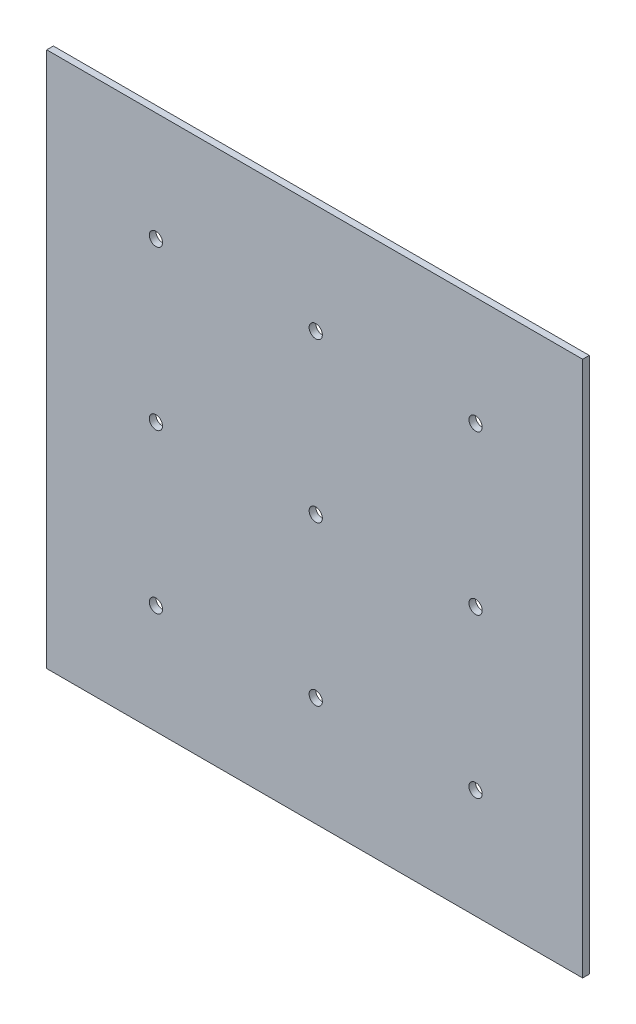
ISO-10303-21;
HEADER;
FILE_DESCRIPTION(('STEP AP214'),'2;1');
FILE_NAME('part.step','',(''),(''),'','','');
FILE_SCHEMA(('AUTOMOTIVE_DESIGN { 1 0 10303 214 1 1 1 1 }'));
ENDSEC;
DATA;
#1=APPLICATION_CONTEXT('core data for automotive mechanical design processes');
#2=APPLICATION_PROTOCOL_DEFINITION('international standard','automotive_design',2000,#1);
#3=PRODUCT_CONTEXT('',#1,'mechanical');
#4=PRODUCT('Part','Part','',(#3));
#5=PRODUCT_RELATED_PRODUCT_CATEGORY('part','',(#4));
#6=PRODUCT_DEFINITION_FORMATION('','',#4);
#7=PRODUCT_DEFINITION_CONTEXT('part definition',#1,'design');
#8=PRODUCT_DEFINITION('design','',#6,#7);
#9=PRODUCT_DEFINITION_SHAPE('','',#8);
#10=(LENGTH_UNIT() NAMED_UNIT(*) SI_UNIT(.MILLI.,.METRE.));
#11=(NAMED_UNIT(*) PLANE_ANGLE_UNIT() SI_UNIT($,.RADIAN.));
#12=(NAMED_UNIT(*) SI_UNIT($,.STERADIAN.) SOLID_ANGLE_UNIT());
#13=UNCERTAINTY_MEASURE_WITH_UNIT(LENGTH_MEASURE(1.E-05),#10,'distance_accuracy_value','');
#14=(GEOMETRIC_REPRESENTATION_CONTEXT(3) GLOBAL_UNCERTAINTY_ASSIGNED_CONTEXT((#13)) GLOBAL_UNIT_ASSIGNED_CONTEXT((#10,
#11,#12)) REPRESENTATION_CONTEXT('',''));
#15=CARTESIAN_POINT('',(0.,0.,0.));
#16=DIRECTION('',(0.,0.,1.));
#17=DIRECTION('',(1.,0.,0.));
#18=AXIS2_PLACEMENT_3D('',#15,#16,#17);
#19=CARTESIAN_POINT('',(195.,-195.,5.));
#20=DIRECTION('',(-1.,0.,0.));
#21=DIRECTION('',(0.,0.,1.));
#22=AXIS2_PLACEMENT_3D('',#19,#20,#21);
#23=PLANE('',#22);
#24=DIRECTION('',(0.,1.,0.));
#25=VECTOR('',#24,1.);
#26=CARTESIAN_POINT('',(195.,-195.,0.));
#27=LINE('',#26,#25);
#28=CARTESIAN_POINT('',(195.,-195.,0.));
#29=VERTEX_POINT('',#28);
#30=CARTESIAN_POINT('',(195.,210.,0.));
#31=VERTEX_POINT('',#30);
#32=EDGE_CURVE('E107',#29,#31,#27,.T.);
#33=ORIENTED_EDGE('',*,*,#32,.T.);
#34=DIRECTION('',(0.,0.,-1.));
#35=VECTOR('',#34,1.);
#36=CARTESIAN_POINT('',(195.,210.,5.));
#37=LINE('',#36,#35);
#38=CARTESIAN_POINT('',(195.,210.,5.));
#39=VERTEX_POINT('',#38);
#40=EDGE_CURVE('E11',#39,#31,#37,.T.);
#41=ORIENTED_EDGE('',*,*,#40,.F.);
#42=DIRECTION('',(0.,1.,0.));
#43=VECTOR('',#42,1.);
#44=CARTESIAN_POINT('',(195.,-195.,5.));
#45=LINE('',#44,#43);
#46=CARTESIAN_POINT('',(195.,-195.,5.));
#47=VERTEX_POINT('',#46);
#48=EDGE_CURVE('E91',#47,#39,#45,.T.);
#49=ORIENTED_EDGE('',*,*,#48,.F.);
#50=DIRECTION('',(0.,0.,-1.));
#51=VECTOR('',#50,1.);
#52=CARTESIAN_POINT('',(195.,-195.,5.));
#53=LINE('',#52,#51);
#54=EDGE_CURVE('E103',#47,#29,#53,.T.);
#55=ORIENTED_EDGE('',*,*,#54,.T.);
#56=EDGE_LOOP('',(#33,#41,#49,#55));
#57=FACE_BOUND('',#56,.T.);
#58=ADVANCED_FACE('F39',(#57),#23,.F.);
#59=CARTESIAN_POINT('',(195.,210.,5.));
#60=DIRECTION('',(0.,-1.,0.));
#61=DIRECTION('',(1.,0.,0.));
#62=AXIS2_PLACEMENT_3D('',#59,#60,#61);
#63=PLANE('',#62);
#64=DIRECTION('',(-1.,0.,0.));
#65=VECTOR('',#64,1.);
#66=CARTESIAN_POINT('',(195.,210.,0.));
#67=LINE('',#66,#65);
#68=CARTESIAN_POINT('',(-210.,210.,0.));
#69=VERTEX_POINT('',#68);
#70=EDGE_CURVE('E96',#31,#69,#67,.T.);
#71=ORIENTED_EDGE('',*,*,#70,.T.);
#72=DIRECTION('',(0.,0.,-1.));
#73=VECTOR('',#72,1.);
#74=CARTESIAN_POINT('',(-210.,210.,5.));
#75=LINE('',#74,#73);
#76=CARTESIAN_POINT('',(-210.,210.,5.));
#77=VERTEX_POINT('',#76);
#78=EDGE_CURVE('E48',#77,#69,#75,.T.);
#79=ORIENTED_EDGE('',*,*,#78,.F.);
#80=DIRECTION('',(-1.,0.,0.));
#81=VECTOR('',#80,1.);
#82=CARTESIAN_POINT('',(195.,210.,5.));
#83=LINE('',#82,#81);
#84=EDGE_CURVE('E86',#39,#77,#83,.T.);
#85=ORIENTED_EDGE('',*,*,#84,.F.);
#86=ORIENTED_EDGE('',*,*,#40,.T.);
#87=EDGE_LOOP('',(#71,#79,#85,#86));
#88=FACE_BOUND('',#87,.T.);
#89=ADVANCED_FACE('F95',(#88),#63,.F.);
#90=CARTESIAN_POINT('',(-210.,210.,5.));
#91=DIRECTION('',(1.,0.,0.));
#92=DIRECTION('',(0.,1.,0.));
#93=AXIS2_PLACEMENT_3D('',#90,#91,#92);
#94=PLANE('',#93);
#95=DIRECTION('',(0.,-1.,0.));
#96=VECTOR('',#95,1.);
#97=CARTESIAN_POINT('',(-210.,210.,0.));
#98=LINE('',#97,#96);
#99=CARTESIAN_POINT('',(-210.,-195.,0.));
#100=VERTEX_POINT('',#99);
#101=EDGE_CURVE('E73',#69,#100,#98,.T.);
#102=ORIENTED_EDGE('',*,*,#101,.T.);
#103=DIRECTION('',(0.,0.,-1.));
#104=VECTOR('',#103,1.);
#105=CARTESIAN_POINT('',(-210.,-195.,5.));
#106=LINE('',#105,#104);
#107=CARTESIAN_POINT('',(-210.,-195.,5.));
#108=VERTEX_POINT('',#107);
#109=EDGE_CURVE('E98',#108,#100,#106,.T.);
#110=ORIENTED_EDGE('',*,*,#109,.F.);
#111=DIRECTION('',(0.,-1.,0.));
#112=VECTOR('',#111,1.);
#113=CARTESIAN_POINT('',(-210.,210.,5.));
#114=LINE('',#113,#112);
#115=EDGE_CURVE('E89',#77,#108,#114,.T.);
#116=ORIENTED_EDGE('',*,*,#115,.F.);
#117=ORIENTED_EDGE('',*,*,#78,.T.);
#118=EDGE_LOOP('',(#102,#110,#116,#117));
#119=FACE_BOUND('',#118,.T.);
#120=ADVANCED_FACE('F99',(#119),#94,.F.);
#121=CARTESIAN_POINT('',(-210.,-195.,5.));
#122=DIRECTION('',(0.,1.,0.));
#123=DIRECTION('',(-1.,0.,0.));
#124=AXIS2_PLACEMENT_3D('',#121,#122,#123);
#125=PLANE('',#124);
#126=DIRECTION('',(1.,0.,0.));
#127=VECTOR('',#126,1.);
#128=CARTESIAN_POINT('',(-210.,-195.,0.));
#129=LINE('',#128,#127);
#130=EDGE_CURVE('E79',#100,#29,#129,.T.);
#131=ORIENTED_EDGE('',*,*,#130,.T.);
#132=ORIENTED_EDGE('',*,*,#54,.F.);
#133=DIRECTION('',(1.,0.,0.));
#134=VECTOR('',#133,1.);
#135=CARTESIAN_POINT('',(-210.,-195.,5.));
#136=LINE('',#135,#134);
#137=EDGE_CURVE('E56',#108,#47,#136,.T.);
#138=ORIENTED_EDGE('',*,*,#137,.F.);
#139=ORIENTED_EDGE('',*,*,#109,.T.);
#140=EDGE_LOOP('',(#131,#132,#138,#139));
#141=FACE_BOUND('',#140,.T.);
#142=ADVANCED_FACE('F121',(#141),#125,.F.);
#143=CARTESIAN_POINT('',(0.,0.,5.));
#144=DIRECTION('',(0.,0.,1.));
#145=DIRECTION('',(1.,0.,0.));
#146=AXIS2_PLACEMENT_3D('',#143,#144,#145);
#147=PLANE('',#146);
#148=CARTESIAN_POINT('',(114.07933778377,-112.5,5.));
#149=DIRECTION('',(0.,0.,1.));
#150=DIRECTION('',(1.,0.,0.));
#151=AXIS2_PLACEMENT_3D('',#148,#149,#150);
#152=CIRCLE('',#151,4.99999999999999);
#153=CARTESIAN_POINT('',(119.07933778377,-112.5,5.));
#154=VERTEX_POINT('',#153);
#155=EDGE_CURVE('E195',#154,#154,#152,.T.);
#156=ORIENTED_EDGE('',*,*,#155,.F.);
#157=EDGE_LOOP('',(#156));
#158=FACE_BOUND('',#157,.T.);
#159=CARTESIAN_POINT('',(114.07933778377,7.49999999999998,5.));
#160=DIRECTION('',(0.,0.,1.));
#161=DIRECTION('',(1.,0.,0.));
#162=AXIS2_PLACEMENT_3D('',#159,#160,#161);
#163=CIRCLE('',#162,4.99999999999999);
#164=CARTESIAN_POINT('',(119.07933778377,7.49999999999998,5.));
#165=VERTEX_POINT('',#164);
#166=EDGE_CURVE('E187',#165,#165,#163,.T.);
#167=ORIENTED_EDGE('',*,*,#166,.F.);
#168=EDGE_LOOP('',(#167));
#169=FACE_BOUND('',#168,.T.);
#170=CARTESIAN_POINT('',(114.07933778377,127.5,5.));
#171=DIRECTION('',(0.,0.,1.));
#172=DIRECTION('',(1.,0.,0.));
#173=AXIS2_PLACEMENT_3D('',#170,#171,#172);
#174=CIRCLE('',#173,4.99999999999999);
#175=CARTESIAN_POINT('',(119.07933778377,127.5,5.));
#176=VERTEX_POINT('',#175);
#177=EDGE_CURVE('E179',#176,#176,#174,.T.);
#178=ORIENTED_EDGE('',*,*,#177,.F.);
#179=EDGE_LOOP('',(#178));
#180=FACE_BOUND('',#179,.T.);
#181=CARTESIAN_POINT('',(-6.71033110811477,-112.5,5.));
#182=DIRECTION('',(0.,0.,1.));
#183=DIRECTION('',(1.,0.,0.));
#184=AXIS2_PLACEMENT_3D('',#181,#182,#183);
#185=CIRCLE('',#184,4.99999999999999);
#186=CARTESIAN_POINT('',(-1.71033110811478,-112.5,5.));
#187=VERTEX_POINT('',#186);
#188=EDGE_CURVE('E171',#187,#187,#185,.T.);
#189=ORIENTED_EDGE('',*,*,#188,.F.);
#190=EDGE_LOOP('',(#189));
#191=FACE_BOUND('',#190,.T.);
#192=CARTESIAN_POINT('',(-6.71033110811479,7.49999999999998,5.));
#193=DIRECTION('',(0.,0.,1.));
#194=DIRECTION('',(1.,0.,0.));
#195=AXIS2_PLACEMENT_3D('',#192,#193,#194);
#196=CIRCLE('',#195,4.99999999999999);
#197=CARTESIAN_POINT('',(-1.71033110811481,7.49999999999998,5.));
#198=VERTEX_POINT('',#197);
#199=EDGE_CURVE('E163',#198,#198,#196,.T.);
#200=ORIENTED_EDGE('',*,*,#199,.F.);
#201=EDGE_LOOP('',(#200));
#202=FACE_BOUND('',#201,.T.);
#203=CARTESIAN_POINT('',(-6.71033110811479,127.5,5.));
#204=DIRECTION('',(0.,0.,1.));
#205=DIRECTION('',(1.,0.,0.));
#206=AXIS2_PLACEMENT_3D('',#203,#204,#205);
#207=CIRCLE('',#206,4.99999999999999);
#208=CARTESIAN_POINT('',(-1.71033110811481,127.5,5.));
#209=VERTEX_POINT('',#208);
#210=EDGE_CURVE('E155',#209,#209,#207,.T.);
#211=ORIENTED_EDGE('',*,*,#210,.F.);
#212=EDGE_LOOP('',(#211));
#213=FACE_BOUND('',#212,.T.);
#214=CARTESIAN_POINT('',(-127.5,-112.5,5.));
#215=DIRECTION('',(0.,0.,1.));
#216=DIRECTION('',(1.,0.,0.));
#217=AXIS2_PLACEMENT_3D('',#214,#215,#216);
#218=CIRCLE('',#217,4.99999999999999);
#219=CARTESIAN_POINT('',(-122.5,-112.5,5.));
#220=VERTEX_POINT('',#219);
#221=EDGE_CURVE('E147',#220,#220,#218,.T.);
#222=ORIENTED_EDGE('',*,*,#221,.F.);
#223=EDGE_LOOP('',(#222));
#224=FACE_BOUND('',#223,.T.);
#225=CARTESIAN_POINT('',(-127.5,7.49999999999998,5.));
#226=DIRECTION('',(0.,0.,1.));
#227=DIRECTION('',(1.,0.,0.));
#228=AXIS2_PLACEMENT_3D('',#225,#226,#227);
#229=CIRCLE('',#228,4.99999999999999);
#230=CARTESIAN_POINT('',(-122.5,7.49999999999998,5.));
#231=VERTEX_POINT('',#230);
#232=EDGE_CURVE('E139',#231,#231,#229,.T.);
#233=ORIENTED_EDGE('',*,*,#232,.F.);
#234=EDGE_LOOP('',(#233));
#235=FACE_BOUND('',#234,.T.);
#236=CARTESIAN_POINT('',(-127.5,127.5,5.));
#237=DIRECTION('',(0.,0.,1.));
#238=DIRECTION('',(1.,0.,0.));
#239=AXIS2_PLACEMENT_3D('',#236,#237,#238);
#240=CIRCLE('',#239,4.99999999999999);
#241=CARTESIAN_POINT('',(-122.5,127.5,5.));
#242=VERTEX_POINT('',#241);
#243=EDGE_CURVE('E131',#242,#242,#240,.T.);
#244=ORIENTED_EDGE('',*,*,#243,.F.);
#245=EDGE_LOOP('',(#244));
#246=FACE_BOUND('',#245,.T.);
#247=ORIENTED_EDGE('',*,*,#48,.T.);
#248=ORIENTED_EDGE('',*,*,#84,.T.);
#249=ORIENTED_EDGE('',*,*,#115,.T.);
#250=ORIENTED_EDGE('',*,*,#137,.T.);
#251=EDGE_LOOP('',(#247,#248,#249,#250));
#252=FACE_BOUND('',#251,.T.);
#253=ADVANCED_FACE('F87',(#158,#169,#180,#191,#202,#213,#224,#235,#246,#252),#147,.T.);
#254=CARTESIAN_POINT('',(0.,0.,0.));
#255=DIRECTION('',(0.,0.,1.));
#256=DIRECTION('',(1.,0.,0.));
#257=AXIS2_PLACEMENT_3D('',#254,#255,#256);
#258=PLANE('',#257);
#259=CARTESIAN_POINT('',(114.07933778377,-112.5,0.));
#260=DIRECTION('',(0.,0.,1.));
#261=DIRECTION('',(1.,0.,0.));
#262=AXIS2_PLACEMENT_3D('',#259,#260,#261);
#263=CIRCLE('',#262,5.);
#264=CARTESIAN_POINT('',(119.07933778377,-112.5,0.));
#265=VERTEX_POINT('',#264);
#266=EDGE_CURVE('E191',#265,#265,#263,.T.);
#267=ORIENTED_EDGE('',*,*,#266,.T.);
#268=EDGE_LOOP('',(#267));
#269=FACE_BOUND('',#268,.T.);
#270=CARTESIAN_POINT('',(114.07933778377,7.49999999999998,0.));
#271=DIRECTION('',(0.,0.,1.));
#272=DIRECTION('',(1.,0.,0.));
#273=AXIS2_PLACEMENT_3D('',#270,#271,#272);
#274=CIRCLE('',#273,5.);
#275=CARTESIAN_POINT('',(119.07933778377,7.49999999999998,0.));
#276=VERTEX_POINT('',#275);
#277=EDGE_CURVE('E183',#276,#276,#274,.T.);
#278=ORIENTED_EDGE('',*,*,#277,.T.);
#279=EDGE_LOOP('',(#278));
#280=FACE_BOUND('',#279,.T.);
#281=CARTESIAN_POINT('',(114.07933778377,127.5,0.));
#282=DIRECTION('',(0.,0.,1.));
#283=DIRECTION('',(1.,0.,0.));
#284=AXIS2_PLACEMENT_3D('',#281,#282,#283);
#285=CIRCLE('',#284,5.);
#286=CARTESIAN_POINT('',(119.07933778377,127.5,0.));
#287=VERTEX_POINT('',#286);
#288=EDGE_CURVE('E175',#287,#287,#285,.T.);
#289=ORIENTED_EDGE('',*,*,#288,.T.);
#290=EDGE_LOOP('',(#289));
#291=FACE_BOUND('',#290,.T.);
#292=CARTESIAN_POINT('',(-6.71033110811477,-112.5,0.));
#293=DIRECTION('',(0.,0.,1.));
#294=DIRECTION('',(1.,0.,0.));
#295=AXIS2_PLACEMENT_3D('',#292,#293,#294);
#296=CIRCLE('',#295,4.99999999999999);
#297=CARTESIAN_POINT('',(-1.71033110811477,-112.5,0.));
#298=VERTEX_POINT('',#297);
#299=EDGE_CURVE('E167',#298,#298,#296,.T.);
#300=ORIENTED_EDGE('',*,*,#299,.T.);
#301=EDGE_LOOP('',(#300));
#302=FACE_BOUND('',#301,.T.);
#303=CARTESIAN_POINT('',(-6.71033110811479,7.49999999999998,0.));
#304=DIRECTION('',(0.,0.,1.));
#305=DIRECTION('',(1.,0.,0.));
#306=AXIS2_PLACEMENT_3D('',#303,#304,#305);
#307=CIRCLE('',#306,4.99999999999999);
#308=CARTESIAN_POINT('',(-1.7103311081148,7.49999999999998,0.));
#309=VERTEX_POINT('',#308);
#310=EDGE_CURVE('E159',#309,#309,#307,.T.);
#311=ORIENTED_EDGE('',*,*,#310,.T.);
#312=EDGE_LOOP('',(#311));
#313=FACE_BOUND('',#312,.T.);
#314=CARTESIAN_POINT('',(-6.71033110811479,127.5,0.));
#315=DIRECTION('',(0.,0.,1.));
#316=DIRECTION('',(1.,0.,0.));
#317=AXIS2_PLACEMENT_3D('',#314,#315,#316);
#318=CIRCLE('',#317,4.99999999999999);
#319=CARTESIAN_POINT('',(-1.7103311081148,127.5,0.));
#320=VERTEX_POINT('',#319);
#321=EDGE_CURVE('E151',#320,#320,#318,.T.);
#322=ORIENTED_EDGE('',*,*,#321,.T.);
#323=EDGE_LOOP('',(#322));
#324=FACE_BOUND('',#323,.T.);
#325=CARTESIAN_POINT('',(-127.5,-112.5,0.));
#326=DIRECTION('',(0.,0.,1.));
#327=DIRECTION('',(1.,0.,0.));
#328=AXIS2_PLACEMENT_3D('',#325,#326,#327);
#329=CIRCLE('',#328,5.);
#330=CARTESIAN_POINT('',(-122.5,-112.5,0.));
#331=VERTEX_POINT('',#330);
#332=EDGE_CURVE('E143',#331,#331,#329,.T.);
#333=ORIENTED_EDGE('',*,*,#332,.T.);
#334=EDGE_LOOP('',(#333));
#335=FACE_BOUND('',#334,.T.);
#336=CARTESIAN_POINT('',(-127.5,7.49999999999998,0.));
#337=DIRECTION('',(0.,0.,1.));
#338=DIRECTION('',(1.,0.,0.));
#339=AXIS2_PLACEMENT_3D('',#336,#337,#338);
#340=CIRCLE('',#339,5.);
#341=CARTESIAN_POINT('',(-122.5,7.49999999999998,0.));
#342=VERTEX_POINT('',#341);
#343=EDGE_CURVE('E135',#342,#342,#340,.T.);
#344=ORIENTED_EDGE('',*,*,#343,.T.);
#345=EDGE_LOOP('',(#344));
#346=FACE_BOUND('',#345,.T.);
#347=CARTESIAN_POINT('',(-127.5,127.5,0.));
#348=DIRECTION('',(0.,0.,1.));
#349=DIRECTION('',(1.,0.,0.));
#350=AXIS2_PLACEMENT_3D('',#347,#348,#349);
#351=CIRCLE('',#350,5.);
#352=CARTESIAN_POINT('',(-122.5,127.5,0.));
#353=VERTEX_POINT('',#352);
#354=EDGE_CURVE('E111',#353,#353,#351,.T.);
#355=ORIENTED_EDGE('',*,*,#354,.T.);
#356=EDGE_LOOP('',(#355));
#357=FACE_BOUND('',#356,.T.);
#358=ORIENTED_EDGE('',*,*,#32,.F.);
#359=ORIENTED_EDGE('',*,*,#130,.F.);
#360=ORIENTED_EDGE('',*,*,#101,.F.);
#361=ORIENTED_EDGE('',*,*,#70,.F.);
#362=EDGE_LOOP('',(#358,#359,#360,#361));
#363=FACE_BOUND('',#362,.T.);
#364=ADVANCED_FACE('F124',(#269,#280,#291,#302,#313,#324,#335,#346,#357,#363),#258,.F.);
#365=CARTESIAN_POINT('',(-127.5,127.5,5.));
#366=DIRECTION('',(0.,0.,1.));
#367=DIRECTION('',(1.,0.,0.));
#368=AXIS2_PLACEMENT_3D('',#365,#366,#367);
#369=CYLINDRICAL_SURFACE('',#368,5.);
#370=ORIENTED_EDGE('',*,*,#354,.F.);
#371=EDGE_LOOP('',(#370));
#372=FACE_BOUND('',#371,.T.);
#373=ORIENTED_EDGE('',*,*,#243,.T.);
#374=EDGE_LOOP('',(#373));
#375=FACE_BOUND('',#374,.T.);
#376=ADVANCED_FACE('F221',(#372,#375),#369,.F.);
#377=CARTESIAN_POINT('',(-127.5,7.49999999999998,5.));
#378=DIRECTION('',(0.,0.,1.));
#379=DIRECTION('',(1.,0.,0.));
#380=AXIS2_PLACEMENT_3D('',#377,#378,#379);
#381=CYLINDRICAL_SURFACE('',#380,5.);
#382=ORIENTED_EDGE('',*,*,#343,.F.);
#383=EDGE_LOOP('',(#382));
#384=FACE_BOUND('',#383,.T.);
#385=ORIENTED_EDGE('',*,*,#232,.T.);
#386=EDGE_LOOP('',(#385));
#387=FACE_BOUND('',#386,.T.);
#388=ADVANCED_FACE('F223',(#384,#387),#381,.F.);
#389=CARTESIAN_POINT('',(-127.5,-112.5,5.));
#390=DIRECTION('',(0.,0.,1.));
#391=DIRECTION('',(1.,0.,0.));
#392=AXIS2_PLACEMENT_3D('',#389,#390,#391);
#393=CYLINDRICAL_SURFACE('',#392,5.);
#394=ORIENTED_EDGE('',*,*,#332,.F.);
#395=EDGE_LOOP('',(#394));
#396=FACE_BOUND('',#395,.T.);
#397=ORIENTED_EDGE('',*,*,#221,.T.);
#398=EDGE_LOOP('',(#397));
#399=FACE_BOUND('',#398,.T.);
#400=ADVANCED_FACE('F230',(#396,#399),#393,.F.);
#401=CARTESIAN_POINT('',(-6.71033110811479,127.5,5.));
#402=DIRECTION('',(0.,0.,1.));
#403=DIRECTION('',(1.,0.,0.));
#404=AXIS2_PLACEMENT_3D('',#401,#402,#403);
#405=CYLINDRICAL_SURFACE('',#404,4.99999999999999);
#406=ORIENTED_EDGE('',*,*,#321,.F.);
#407=EDGE_LOOP('',(#406));
#408=FACE_BOUND('',#407,.T.);
#409=ORIENTED_EDGE('',*,*,#210,.T.);
#410=EDGE_LOOP('',(#409));
#411=FACE_BOUND('',#410,.T.);
#412=ADVANCED_FACE('F276',(#408,#411),#405,.F.);
#413=CARTESIAN_POINT('',(-6.71033110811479,7.49999999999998,5.));
#414=DIRECTION('',(0.,0.,1.));
#415=DIRECTION('',(1.,0.,0.));
#416=AXIS2_PLACEMENT_3D('',#413,#414,#415);
#417=CYLINDRICAL_SURFACE('',#416,4.99999999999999);
#418=ORIENTED_EDGE('',*,*,#310,.F.);
#419=EDGE_LOOP('',(#418));
#420=FACE_BOUND('',#419,.T.);
#421=ORIENTED_EDGE('',*,*,#199,.T.);
#422=EDGE_LOOP('',(#421));
#423=FACE_BOUND('',#422,.T.);
#424=ADVANCED_FACE('F286',(#420,#423),#417,.F.);
#425=CARTESIAN_POINT('',(-6.71033110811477,-112.5,5.));
#426=DIRECTION('',(0.,0.,1.));
#427=DIRECTION('',(1.,0.,0.));
#428=AXIS2_PLACEMENT_3D('',#425,#426,#427);
#429=CYLINDRICAL_SURFACE('',#428,4.99999999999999);
#430=ORIENTED_EDGE('',*,*,#299,.F.);
#431=EDGE_LOOP('',(#430));
#432=FACE_BOUND('',#431,.T.);
#433=ORIENTED_EDGE('',*,*,#188,.T.);
#434=EDGE_LOOP('',(#433));
#435=FACE_BOUND('',#434,.T.);
#436=ADVANCED_FACE('F296',(#432,#435),#429,.F.);
#437=CARTESIAN_POINT('',(114.07933778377,127.5,5.));
#438=DIRECTION('',(0.,0.,1.));
#439=DIRECTION('',(1.,0.,0.));
#440=AXIS2_PLACEMENT_3D('',#437,#438,#439);
#441=CYLINDRICAL_SURFACE('',#440,5.);
#442=ORIENTED_EDGE('',*,*,#288,.F.);
#443=EDGE_LOOP('',(#442));
#444=FACE_BOUND('',#443,.T.);
#445=ORIENTED_EDGE('',*,*,#177,.T.);
#446=EDGE_LOOP('',(#445));
#447=FACE_BOUND('',#446,.T.);
#448=ADVANCED_FACE('F306',(#444,#447),#441,.F.);
#449=CARTESIAN_POINT('',(114.07933778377,7.49999999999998,5.));
#450=DIRECTION('',(0.,0.,1.));
#451=DIRECTION('',(1.,0.,0.));
#452=AXIS2_PLACEMENT_3D('',#449,#450,#451);
#453=CYLINDRICAL_SURFACE('',#452,5.);
#454=ORIENTED_EDGE('',*,*,#277,.F.);
#455=EDGE_LOOP('',(#454));
#456=FACE_BOUND('',#455,.T.);
#457=ORIENTED_EDGE('',*,*,#166,.T.);
#458=EDGE_LOOP('',(#457));
#459=FACE_BOUND('',#458,.T.);
#460=ADVANCED_FACE('F316',(#456,#459),#453,.F.);
#461=CARTESIAN_POINT('',(114.07933778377,-112.5,5.));
#462=DIRECTION('',(0.,0.,1.));
#463=DIRECTION('',(1.,0.,0.));
#464=AXIS2_PLACEMENT_3D('',#461,#462,#463);
#465=CYLINDRICAL_SURFACE('',#464,5.);
#466=ORIENTED_EDGE('',*,*,#266,.F.);
#467=EDGE_LOOP('',(#466));
#468=FACE_BOUND('',#467,.T.);
#469=ORIENTED_EDGE('',*,*,#155,.T.);
#470=EDGE_LOOP('',(#469));
#471=FACE_BOUND('',#470,.T.);
#472=ADVANCED_FACE('F200',(#468,#471),#465,.F.);
#473=CLOSED_SHELL('',(#58,#89,#120,#142,#253,#364,#376,#388,#400,#412,#424,#436,#448,#460,#472));
#474=MANIFOLD_SOLID_BREP('B2',#473);
#475=ADVANCED_BREP_SHAPE_REPRESENTATION('',(#18,#474),#14);
#476=SHAPE_DEFINITION_REPRESENTATION(#9,#475);
ENDSEC;
END-ISO-10303-21;
